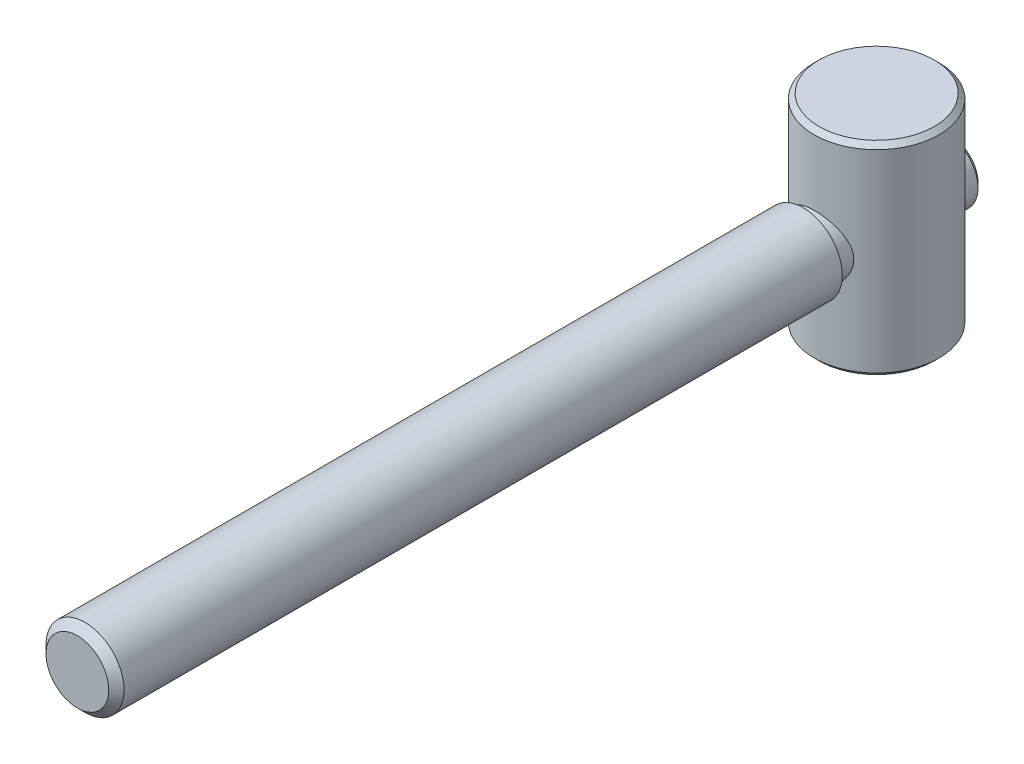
ISO-10303-21;
HEADER;
FILE_DESCRIPTION(('STEP AP214'),'2;1');
FILE_NAME('part.step','',(''),(''),'','','');
FILE_SCHEMA(('AUTOMOTIVE_DESIGN { 1 0 10303 214 1 1 1 1 }'));
ENDSEC;
DATA;
#1=APPLICATION_CONTEXT('core data for automotive mechanical design processes');
#2=APPLICATION_PROTOCOL_DEFINITION('international standard','automotive_design',2000,#1);
#3=PRODUCT_CONTEXT('',#1,'mechanical');
#4=PRODUCT('Part','Part','',(#3));
#5=PRODUCT_RELATED_PRODUCT_CATEGORY('part','',(#4));
#6=PRODUCT_DEFINITION_FORMATION('','',#4);
#7=PRODUCT_DEFINITION_CONTEXT('part definition',#1,'design');
#8=PRODUCT_DEFINITION('design','',#6,#7);
#9=PRODUCT_DEFINITION_SHAPE('','',#8);
#10=(LENGTH_UNIT() NAMED_UNIT(*) SI_UNIT(.MILLI.,.METRE.));
#11=(NAMED_UNIT(*) PLANE_ANGLE_UNIT() SI_UNIT($,.RADIAN.));
#12=(NAMED_UNIT(*) SI_UNIT($,.STERADIAN.) SOLID_ANGLE_UNIT());
#13=UNCERTAINTY_MEASURE_WITH_UNIT(LENGTH_MEASURE(1.E-05),#10,'distance_accuracy_value','');
#14=(GEOMETRIC_REPRESENTATION_CONTEXT(3) GLOBAL_UNCERTAINTY_ASSIGNED_CONTEXT((#13)) GLOBAL_UNIT_ASSIGNED_CONTEXT((#10,
#11,#12)) REPRESENTATION_CONTEXT('',''));
#15=CARTESIAN_POINT('',(0.,0.,0.));
#16=DIRECTION('',(0.,0.,1.));
#17=DIRECTION('',(1.,0.,0.));
#18=AXIS2_PLACEMENT_3D('',#15,#16,#17);
#19=CARTESIAN_POINT('',(-0.4,0.,-46.2));
#20=DIRECTION('',(1.,0.,0.));
#21=DIRECTION('',(0.,-1.,0.));
#22=AXIS2_PLACEMENT_3D('',#19,#20,#21);
#23=CYLINDRICAL_SURFACE('',#22,31.5);
#24=CARTESIAN_POINT('',(-0.4,0.,-46.2));
#25=DIRECTION('',(-1.,0.,0.));
#26=DIRECTION('',(0.,1.,0.));
#27=AXIS2_PLACEMENT_3D('',#24,#25,#26);
#28=CIRCLE('',#27,31.5);
#29=CARTESIAN_POINT('',(-0.4,-1.95959179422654,-14.7610114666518));
#30=VERTEX_POINT('',#29);
#31=CARTESIAN_POINT('',(-0.4,1.95959179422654,-14.7610114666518));
#32=VERTEX_POINT('',#31);
#33=EDGE_CURVE('E118',#30,#32,#28,.T.);
#34=ORIENTED_EDGE('',*,*,#33,.T.);
#35=CARTESIAN_POINT('',(-0.4,1.95959179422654,-14.7610114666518));
#36=CARTESIAN_POINT('',(-0.344561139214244,1.97091486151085,-14.7617184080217));
#37=CARTESIAN_POINT('',(-0.28863792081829,1.97987306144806,-14.762281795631));
#38=CARTESIAN_POINT('',(-0.176213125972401,1.99302430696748,-14.7631121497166));
#39=CARTESIAN_POINT('',(-0.119711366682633,1.99721579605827,-14.7633790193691));
#40=CARTESIAN_POINT('',(-0.00749894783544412,2.0007609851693,-14.7636046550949));
#41=CARTESIAN_POINT('',(0.0482092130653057,2.00019410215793,-14.7635684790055));
#42=CARTESIAN_POINT('',(0.159360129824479,1.99441663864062,-14.7632012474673));
#43=CARTESIAN_POINT('',(0.214802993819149,1.98920814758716,-14.7628703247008));
#44=CARTESIAN_POINT('',(0.313516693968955,1.97576492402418,-14.762023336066));
#45=CARTESIAN_POINT('',(0.356906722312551,1.96839158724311,-14.761560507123));
#46=CARTESIAN_POINT('',(0.4,1.95959179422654,-14.7610114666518));
#47=B_SPLINE_CURVE_WITH_KNOTS('',3,(#35,#36,#37,#38,#39,#40,#41,#42,#43,#44,#45,#46),
.UNSPECIFIED.,.F.,.F.,(4,2,2,2,2,4),(0.,0.169712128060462,0.33947965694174,0.506419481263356,
0.673284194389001,0.805229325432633),.UNSPECIFIED.);
#48=CARTESIAN_POINT('',(0.4,1.95959179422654,-14.7610114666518));
#49=VERTEX_POINT('',#48);
#50=EDGE_CURVE('E208',#32,#49,#47,.T.);
#51=ORIENTED_EDGE('',*,*,#50,.T.);
#52=CARTESIAN_POINT('',(0.4,0.,-46.2));
#53=DIRECTION('',(-1.,0.,0.));
#54=DIRECTION('',(0.,1.,0.));
#55=AXIS2_PLACEMENT_3D('',#52,#53,#54);
#56=CIRCLE('',#55,31.5);
#57=CARTESIAN_POINT('',(0.4,-1.95959179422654,-14.7610114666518));
#58=VERTEX_POINT('',#57);
#59=EDGE_CURVE('E105',#58,#49,#56,.T.);
#60=ORIENTED_EDGE('',*,*,#59,.F.);
#61=CARTESIAN_POINT('',(0.4,-1.95959179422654,-14.7610114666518));
#62=CARTESIAN_POINT('',(0.344561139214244,-1.97091486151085,-14.7617184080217));
#63=CARTESIAN_POINT('',(0.28863792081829,-1.97987306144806,-14.762281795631));
#64=CARTESIAN_POINT('',(0.176213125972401,-1.99302430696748,-14.7631121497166));
#65=CARTESIAN_POINT('',(0.119711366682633,-1.99721579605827,-14.7633790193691));
#66=CARTESIAN_POINT('',(0.00749894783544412,-2.0007609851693,-14.7636046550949));
#67=CARTESIAN_POINT('',(-0.0482092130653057,-2.00019410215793,-14.7635684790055));
#68=CARTESIAN_POINT('',(-0.159360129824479,-1.99441663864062,-14.7632012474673));
#69=CARTESIAN_POINT('',(-0.214802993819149,-1.98920814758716,-14.7628703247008));
#70=CARTESIAN_POINT('',(-0.313516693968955,-1.97576492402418,-14.762023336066));
#71=CARTESIAN_POINT('',(-0.356906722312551,-1.96839158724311,-14.761560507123));
#72=CARTESIAN_POINT('',(-0.4,-1.95959179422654,-14.7610114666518));
#73=B_SPLINE_CURVE_WITH_KNOTS('',3,(#61,#62,#63,#64,#65,#66,#67,#68,#69,#70,#71,#72),
.UNSPECIFIED.,.F.,.F.,(4,2,2,2,2,4),(0.,0.169712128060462,0.33947965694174,0.506419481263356,
0.673284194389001,0.805229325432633),.UNSPECIFIED.);
#74=EDGE_CURVE('E120',#58,#30,#73,.T.);
#75=ORIENTED_EDGE('',*,*,#74,.T.);
#76=EDGE_LOOP('',(#34,#51,#60,#75));
#77=FACE_BOUND('',#76,.T.);
#78=ADVANCED_FACE('F19',(#77),#23,.F.);
#79=CARTESIAN_POINT('',(0.,0.,-6.7));
#80=DIRECTION('',(0.,0.,1.));
#81=DIRECTION('',(1.,0.,0.));
#82=AXIS2_PLACEMENT_3D('',#79,#80,#81);
#83=CYLINDRICAL_SURFACE('',#82,2.);
#84=DIRECTION('',(0.,0.,1.));
#85=VECTOR('',#84,1.);
#86=CARTESIAN_POINT('',(0.4,-1.95959179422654,-16.2));
#87=LINE('',#86,#85);
#88=CARTESIAN_POINT('',(0.4,-1.95959179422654,-15.8935));
#89=VERTEX_POINT('',#88);
#90=CARTESIAN_POINT('',(0.4,-1.95959179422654,-15.3799497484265));
#91=VERTEX_POINT('',#90);
#92=EDGE_CURVE('E315',#89,#91,#87,.T.);
#93=ORIENTED_EDGE('',*,*,#92,.F.);
#94=CARTESIAN_POINT('',(0.,0.,-15.8935));
#95=DIRECTION('',(0.,0.,1.));
#96=DIRECTION('',(1.,0.,0.));
#97=AXIS2_PLACEMENT_3D('',#94,#95,#96);
#98=CIRCLE('',#97,2.);
#99=CARTESIAN_POINT('',(0.4,1.95959179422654,-15.8935));
#100=VERTEX_POINT('',#99);
#101=EDGE_CURVE('E589',#89,#100,#98,.T.);
#102=ORIENTED_EDGE('',*,*,#101,.T.);
#103=DIRECTION('',(0.,0.,1.));
#104=VECTOR('',#103,1.);
#105=CARTESIAN_POINT('',(0.4,1.95959179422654,-16.2));
#106=LINE('',#105,#104);
#107=CARTESIAN_POINT('',(0.4,1.95959179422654,-15.3799497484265));
#108=VERTEX_POINT('',#107);
#109=EDGE_CURVE('E313',#100,#108,#106,.T.);
#110=ORIENTED_EDGE('',*,*,#109,.T.);
#111=CARTESIAN_POINT('',(2.,0.,-14.8641016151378));
#112=CARTESIAN_POINT('',(1.99999158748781,0.104213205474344,-14.8641118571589));
#113=CARTESIAN_POINT('',(1.99179963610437,0.208562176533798,-14.8688763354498));
#114=CARTESIAN_POINT('',(1.95944672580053,0.414055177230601,-14.8872470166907));
#115=CARTESIAN_POINT('',(1.93525221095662,0.515192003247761,-14.9008717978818));
#116=CARTESIAN_POINT('',(1.8721998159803,0.710903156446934,-14.9349870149));
#117=CARTESIAN_POINT('',(1.83341988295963,0.80550925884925,-14.9554408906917));
#118=CARTESIAN_POINT('',(1.74253507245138,0.986848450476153,-15.0008532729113));
#119=CARTESIAN_POINT('',(1.69042947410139,1.07358111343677,-15.0258120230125));
#120=CARTESIAN_POINT('',(1.569333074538,1.24461144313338,-15.0799373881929));
#121=CARTESIAN_POINT('',(1.49930407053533,1.32811826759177,-15.109281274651));
#122=CARTESIAN_POINT('',(1.34650761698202,1.4828167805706,-15.1674396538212));
#123=CARTESIAN_POINT('',(1.26373385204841,1.55400232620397,-15.1962538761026));
#124=CARTESIAN_POINT('',(1.08097912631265,1.6867343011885,-15.2524295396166));
#125=CARTESIAN_POINT('',(0.980214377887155,1.74730753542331,-15.2795621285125));
#126=CARTESIAN_POINT('',(0.768314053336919,1.85028170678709,-15.3270151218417));
#127=CARTESIAN_POINT('',(0.657185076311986,1.8926941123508,-15.3473398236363));
#128=CARTESIAN_POINT('',(0.436089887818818,1.95500932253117,-15.3776092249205));
#129=CARTESIAN_POINT('',(0.326603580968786,1.9762990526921,-15.3881896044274));
#130=CARTESIAN_POINT('',(0.105141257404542,2.00033223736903,-15.4001516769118));
#131=CARTESIAN_POINT('',(-0.00683321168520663,2.00308691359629,-15.4015389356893));
#132=CARTESIAN_POINT('',(-0.219665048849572,1.99050665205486,-15.3952596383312));
#133=CARTESIAN_POINT('',(-0.320642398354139,1.97672396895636,-15.3883699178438));
#134=CARTESIAN_POINT('',(-0.518627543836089,1.93423831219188,-15.3674849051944));
#135=CARTESIAN_POINT('',(-0.615635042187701,1.90553422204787,-15.3534890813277));
#136=CARTESIAN_POINT('',(-0.804618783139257,1.83383486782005,-15.3194316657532));
#137=CARTESIAN_POINT('',(-0.896506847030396,1.79064737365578,-15.299288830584));
#138=CARTESIAN_POINT('',(-1.07195360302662,1.6914731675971,-15.2547529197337));
#139=CARTESIAN_POINT('',(-1.15550929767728,1.63548187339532,-15.2303583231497));
#140=CARTESIAN_POINT('',(-1.3203473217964,1.50620929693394,-15.1768878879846));
#141=CARTESIAN_POINT('',(-1.40066815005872,1.43179394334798,-15.1475875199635));
#142=CARTESIAN_POINT('',(-1.54820874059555,1.27082055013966,-15.0890868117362));
#143=CARTESIAN_POINT('',(-1.61541842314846,1.18425325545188,-15.0598865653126));
#144=CARTESIAN_POINT('',(-1.73901066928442,0.994703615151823,-15.0028831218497));
#145=CARTESIAN_POINT('',(-1.7944346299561,0.89102795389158,-14.9752863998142));
#146=CARTESIAN_POINT('',(-1.88663822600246,0.674124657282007,-14.9275090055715));
#147=CARTESIAN_POINT('',(-1.92343731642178,0.560907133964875,-14.9073206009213));
#148=CARTESIAN_POINT('',(-1.97436042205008,0.337570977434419,-14.8788927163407));
#149=CARTESIAN_POINT('',(-1.99005024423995,0.227917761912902,-14.8698331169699));
#150=CARTESIAN_POINT('',(-2.00303389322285,0.00719731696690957,-14.8623583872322));
#151=CARTESIAN_POINT('',(-2.00034071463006,-0.103868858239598,-14.8639357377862));
#152=CARTESIAN_POINT('',(-1.97807208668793,-0.311307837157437,-14.8766867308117));
#153=CARTESIAN_POINT('',(-1.96037563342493,-0.407958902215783,-14.8867917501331));
#154=CARTESIAN_POINT('',(-1.91139256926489,-0.596735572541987,-14.9138804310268));
#155=CARTESIAN_POINT('',(-1.88010155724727,-0.688859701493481,-14.9308663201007));
#156=CARTESIAN_POINT('',(-1.80329517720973,-0.870822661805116,-14.9707244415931));
#157=CARTESIAN_POINT('',(-1.7571881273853,-0.960358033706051,-14.9938328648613));
#158=CARTESIAN_POINT('',(-1.65257412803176,-1.13093854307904,-15.043122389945));
#159=CARTESIAN_POINT('',(-1.59406080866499,-1.21197928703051,-15.069305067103));
#160=CARTESIAN_POINT('',(-1.45767433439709,-1.37395753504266,-15.1257599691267));
#161=CARTESIAN_POINT('',(-1.37829054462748,-1.45359430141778,-15.1561316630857));
#162=CARTESIAN_POINT('',(-1.20680899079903,-1.59882447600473,-15.214684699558));
#163=CARTESIAN_POINT('',(-1.11470694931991,-1.66441314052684,-15.2428653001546));
#164=CARTESIAN_POINT('',(-0.917070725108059,-1.78114745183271,-15.2948272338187));
#165=CARTESIAN_POINT('',(-0.811246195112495,-1.83186623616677,-15.3184728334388));
#166=CARTESIAN_POINT('',(-0.591044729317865,-1.91427580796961,-15.3576670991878));
#167=CARTESIAN_POINT('',(-0.476675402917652,-1.9459833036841,-15.373222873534));
#168=CARTESIAN_POINT('',(-0.253959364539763,-1.98673712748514,-15.3933501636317));
#169=CARTESIAN_POINT('',(-0.1460228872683,-1.99759574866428,-15.3987985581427));
#170=CARTESIAN_POINT('',(0.0702519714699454,-2.00168653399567,-15.4008426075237));
#171=CARTESIAN_POINT('',(0.178590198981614,-1.99492486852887,-15.3974413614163));
#172=CARTESIAN_POINT('',(0.385075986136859,-1.96516717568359,-15.3826793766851));
#173=CARTESIAN_POINT('',(0.483424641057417,-1.94327026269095,-15.3718578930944));
#174=CARTESIAN_POINT('',(0.674891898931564,-1.88534604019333,-15.3438418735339));
#175=CARTESIAN_POINT('',(0.768009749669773,-1.84931670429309,-15.3266464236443));
#176=CARTESIAN_POINT('',(0.95084683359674,-1.7625457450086,-15.2865186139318));
#177=CARTESIAN_POINT('',(1.04025036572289,-1.71124078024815,-15.263372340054));
#178=CARTESIAN_POINT('',(1.20954920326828,-1.59608471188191,-15.2137626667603));
#179=CARTESIAN_POINT('',(1.28944011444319,-1.53222784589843,-15.1872977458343));
#180=CARTESIAN_POINT('',(1.44582833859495,-1.38640336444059,-15.1305721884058));
#181=CARTESIAN_POINT('',(1.52119665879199,-1.30326581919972,-15.1001959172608));
#182=CARTESIAN_POINT('',(1.65732528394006,-1.12510777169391,-15.0412615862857));
#183=CARTESIAN_POINT('',(1.71807266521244,-1.03007686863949,-15.0127051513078));
#184=CARTESIAN_POINT('',(1.82486714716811,-0.826691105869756,-14.9599918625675));
#185=CARTESIAN_POINT('',(1.87038902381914,-0.718010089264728,-14.9360025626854));
#186=CARTESIAN_POINT('',(1.92395929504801,-0.549421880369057,-14.9069621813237));
#187=CARTESIAN_POINT('',(1.93935666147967,-0.492352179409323,-14.898443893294));
#188=CARTESIAN_POINT('',(1.96508069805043,-0.376767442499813,-14.8840605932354));
#189=CARTESIAN_POINT('',(1.97541091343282,-0.318253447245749,-14.8781937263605));
#190=CARTESIAN_POINT('',(1.9887293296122,-0.21639921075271,-14.8705902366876));
#191=CARTESIAN_POINT('',(1.99295091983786,-0.173266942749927,-14.8681638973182));
#192=CARTESIAN_POINT('',(1.99858810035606,-0.0867643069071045,-14.8649174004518));
#193=CARTESIAN_POINT('',(2.00000350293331,-0.0433939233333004,-14.8640973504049));
#194=CARTESIAN_POINT('',(2.,0.,-14.8641016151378));
#195=B_SPLINE_CURVE_WITH_KNOTS('',3,(#111,#112,#113,#114,#115,#116,#117,#118,#119,#120,#121,
#122,#123,#124,#125,#126,#127,#128,#129,#130,#131,#132,#133,#134,#135,#136,#137,#138,#139,#140,
#141,#142,#143,#144,#145,#146,#147,#148,#149,#150,#151,#152,#153,#154,#155,#156,#157,#158,#159,
#160,#161,#162,#163,#164,#165,#166,#167,#168,#169,#170,#171,#172,#173,#174,#175,#176,#177,#178,
#179,#180,#181,#182,#183,#184,#185,#186,#187,#188,#189,#190,#191,#192,#193,#194),.UNSPECIFIED.,
.T.,.F.,(4,2,2,2,2,2,2,2,2,2,2,2,2,2,2,2,2,2,2,2,2,2,2,2,2,2,2,2,2,2,2,2,2,2,2,2,2,2,2,2,2,4),
(0.,0.312464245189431,0.625585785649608,0.937057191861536,1.24854545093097,1.58572462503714,
1.92307142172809,2.28315784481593,2.64301653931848,2.97726969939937,3.31132047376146,
3.61632194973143,3.92134625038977,4.2305906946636,4.5399459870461,4.87854382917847,
5.21740096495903,5.57777683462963,5.93777548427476,6.2692458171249,6.60048186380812,
6.89548366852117,7.19058104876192,7.49934592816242,7.80826972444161,8.15613487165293,
8.50411729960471,8.86128362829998,9.21813559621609,9.5422454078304,9.8662417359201,
10.1688884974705,10.4715786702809,10.7872150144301,11.102996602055,11.450204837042,
11.7977188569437,12.1562149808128,12.3351395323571,12.5139387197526,12.6440387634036,
12.7741475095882),.UNSPECIFIED.);
#196=EDGE_CURVE('E113',#91,#108,#195,.T.);
#197=ORIENTED_EDGE('',*,*,#196,.F.);
#198=EDGE_LOOP('',(#93,#102,#110,#197));
#199=FACE_BOUND('',#198,.T.);
#200=ADVANCED_FACE('F222',(#199),#83,.T.);
#201=CARTESIAN_POINT('',(0.4,0.,-46.2));
#202=DIRECTION('',(-1.,0.,0.));
#203=DIRECTION('',(0.,1.,0.));
#204=AXIS2_PLACEMENT_3D('',#201,#202,#203);
#205=PLANE('',#204);
#206=DIRECTION('',(0.,1.,0.));
#207=VECTOR('',#206,1.);
#208=CARTESIAN_POINT('',(0.4,1.95959179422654,-16.2));
#209=LINE('',#208,#207);
#210=CARTESIAN_POINT('',(0.4,-1.64558264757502,-16.2));
#211=VERTEX_POINT('',#210);
#212=CARTESIAN_POINT('',(0.4,1.64558264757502,-16.2));
#213=VERTEX_POINT('',#212);
#214=EDGE_CURVE('E309',#211,#213,#209,.T.);
#215=ORIENTED_EDGE('',*,*,#214,.F.);
#216=CARTESIAN_POINT('',(0.4,-1.64558264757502,-16.2));
#217=CARTESIAN_POINT('',(0.4,-1.69802260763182,-16.149024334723));
#218=CARTESIAN_POINT('',(0.4,-1.75041001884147,-16.0979948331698));
#219=CARTESIAN_POINT('',(0.4,-1.85507973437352,-15.9958281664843));
#220=CARTESIAN_POINT('',(0.4,-1.90736203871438,-15.9446910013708));
#221=CARTESIAN_POINT('',(0.4,-1.95959179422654,-15.8935));
#222=B_SPLINE_CURVE_WITH_KNOTS('',3,(#216,#217,#218,#219,#220,#221),.UNSPECIFIED.,.F.,.F.,(4,2,
4),(0.,0.219399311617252,0.438798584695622),.UNSPECIFIED.);
#223=EDGE_CURVE('E249',#211,#89,#222,.T.);
#224=ORIENTED_EDGE('',*,*,#223,.T.);
#225=ORIENTED_EDGE('',*,*,#92,.T.);
#226=DIRECTION('',(0.,0.,1.));
#227=VECTOR('',#226,1.);
#228=CARTESIAN_POINT('',(0.4,-1.95959179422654,-6.7));
#229=LINE('',#228,#227);
#230=EDGE_CURVE('E101',#91,#58,#229,.T.);
#231=ORIENTED_EDGE('',*,*,#230,.T.);
#232=ORIENTED_EDGE('',*,*,#59,.T.);
#233=DIRECTION('',(0.,0.,1.));
#234=VECTOR('',#233,1.);
#235=CARTESIAN_POINT('',(0.4,1.95959179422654,-6.7));
#236=LINE('',#235,#234);
#237=EDGE_CURVE('E197',#49,#108,#236,.F.);
#238=ORIENTED_EDGE('',*,*,#237,.T.);
#239=ORIENTED_EDGE('',*,*,#109,.F.);
#240=CARTESIAN_POINT('',(0.4,1.95959179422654,-15.8935));
#241=CARTESIAN_POINT('',(0.4,1.90736203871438,-15.9446910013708));
#242=CARTESIAN_POINT('',(0.4,1.85507973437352,-15.9958281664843));
#243=CARTESIAN_POINT('',(0.4,1.75041001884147,-16.0979948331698));
#244=CARTESIAN_POINT('',(0.4,1.69802260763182,-16.149024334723));
#245=CARTESIAN_POINT('',(0.4,1.64558264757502,-16.2));
#246=B_SPLINE_CURVE_WITH_KNOTS('',3,(#240,#241,#242,#243,#244,#245),.UNSPECIFIED.,.F.,.F.,(4,2,
4),(0.,0.21939927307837,0.438798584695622),.UNSPECIFIED.);
#247=EDGE_CURVE('E242',#100,#213,#246,.T.);
#248=ORIENTED_EDGE('',*,*,#247,.T.);
#249=EDGE_LOOP('',(#215,#224,#225,#231,#232,#238,#239,#248));
#250=FACE_BOUND('',#249,.T.);
#251=ADVANCED_FACE('F224',(#250),#205,.T.);
#252=DIRECTION('',(0.,0.,1.));
#253=VECTOR('',#252,1.);
#254=CARTESIAN_POINT('',(-0.4,1.95959179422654,-16.2));
#255=LINE('',#254,#253);
#256=CARTESIAN_POINT('',(-0.4,1.95959179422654,-15.8935));
#257=VERTEX_POINT('',#256);
#258=CARTESIAN_POINT('',(-0.4,1.95959179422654,-15.3799497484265));
#259=VERTEX_POINT('',#258);
#260=EDGE_CURVE('E89',#257,#259,#255,.T.);
#261=ORIENTED_EDGE('',*,*,#260,.F.);
#262=CARTESIAN_POINT('',(0.,0.,-15.8935));
#263=DIRECTION('',(0.,0.,1.));
#264=DIRECTION('',(1.,0.,0.));
#265=AXIS2_PLACEMENT_3D('',#262,#263,#264);
#266=CIRCLE('',#265,2.);
#267=CARTESIAN_POINT('',(-0.4,-1.95959179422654,-15.8935));
#268=VERTEX_POINT('',#267);
#269=EDGE_CURVE('E11',#257,#268,#266,.T.);
#270=ORIENTED_EDGE('',*,*,#269,.T.);
#271=DIRECTION('',(0.,0.,1.));
#272=VECTOR('',#271,1.);
#273=CARTESIAN_POINT('',(-0.4,-1.95959179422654,-16.2));
#274=LINE('',#273,#272);
#275=CARTESIAN_POINT('',(-0.4,-1.95959179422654,-15.3799497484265));
#276=VERTEX_POINT('',#275);
#277=EDGE_CURVE('E81',#268,#276,#274,.T.);
#278=ORIENTED_EDGE('',*,*,#277,.T.);
#279=EDGE_CURVE('E85',#259,#276,#195,.T.);
#280=ORIENTED_EDGE('',*,*,#279,.F.);
#281=EDGE_LOOP('',(#261,#270,#278,#280));
#282=FACE_BOUND('',#281,.T.);
#283=ADVANCED_FACE('F83',(#282),#83,.T.);
#284=CARTESIAN_POINT('',(-0.4,0.,-46.2));
#285=DIRECTION('',(-1.,0.,0.));
#286=DIRECTION('',(0.,1.,0.));
#287=AXIS2_PLACEMENT_3D('',#284,#285,#286);
#288=PLANE('',#287);
#289=DIRECTION('',(0.,-1.,0.));
#290=VECTOR('',#289,1.);
#291=CARTESIAN_POINT('',(-0.4,-1.95959179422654,-16.2));
#292=LINE('',#291,#290);
#293=CARTESIAN_POINT('',(-0.4,1.64558264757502,-16.2));
#294=VERTEX_POINT('',#293);
#295=CARTESIAN_POINT('',(-0.4,-1.64558264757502,-16.2));
#296=VERTEX_POINT('',#295);
#297=EDGE_CURVE('E90',#294,#296,#292,.T.);
#298=ORIENTED_EDGE('',*,*,#297,.F.);
#299=CARTESIAN_POINT('',(-0.4,1.64558264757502,-16.2));
#300=CARTESIAN_POINT('',(-0.4,1.69802260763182,-16.149024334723));
#301=CARTESIAN_POINT('',(-0.4,1.75041001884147,-16.0979948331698));
#302=CARTESIAN_POINT('',(-0.4,1.85507973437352,-15.9958281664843));
#303=CARTESIAN_POINT('',(-0.4,1.90736203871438,-15.9446910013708));
#304=CARTESIAN_POINT('',(-0.4,1.95959179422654,-15.8935));
#305=B_SPLINE_CURVE_WITH_KNOTS('',3,(#299,#300,#301,#302,#303,#304),.UNSPECIFIED.,.F.,.F.,(4,2,
4),(0.,0.219399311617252,0.438798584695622),.UNSPECIFIED.);
#306=EDGE_CURVE('E29',#294,#257,#305,.T.);
#307=ORIENTED_EDGE('',*,*,#306,.T.);
#308=ORIENTED_EDGE('',*,*,#260,.T.);
#309=DIRECTION('',(0.,0.,1.));
#310=VECTOR('',#309,1.);
#311=CARTESIAN_POINT('',(-0.4,1.95959179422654,-6.7));
#312=LINE('',#311,#310);
#313=EDGE_CURVE('E164',#32,#259,#312,.F.);
#314=ORIENTED_EDGE('',*,*,#313,.F.);
#315=ORIENTED_EDGE('',*,*,#33,.F.);
#316=DIRECTION('',(0.,0.,1.));
#317=VECTOR('',#316,1.);
#318=CARTESIAN_POINT('',(-0.4,-1.95959179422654,-6.7));
#319=LINE('',#318,#317);
#320=EDGE_CURVE('E99',#276,#30,#319,.T.);
#321=ORIENTED_EDGE('',*,*,#320,.F.);
#322=ORIENTED_EDGE('',*,*,#277,.F.);
#323=CARTESIAN_POINT('',(-0.4,-1.95959179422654,-15.8935));
#324=CARTESIAN_POINT('',(-0.4,-1.90736203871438,-15.9446910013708));
#325=CARTESIAN_POINT('',(-0.4,-1.85507973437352,-15.9958281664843));
#326=CARTESIAN_POINT('',(-0.4,-1.75041001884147,-16.0979948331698));
#327=CARTESIAN_POINT('',(-0.4,-1.69802260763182,-16.149024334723));
#328=CARTESIAN_POINT('',(-0.4,-1.64558264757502,-16.2));
#329=B_SPLINE_CURVE_WITH_KNOTS('',3,(#323,#324,#325,#326,#327,#328),.UNSPECIFIED.,.F.,.F.,(4,2,
4),(0.,0.21939927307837,0.438798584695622),.UNSPECIFIED.);
#330=EDGE_CURVE('E576',#268,#296,#329,.T.);
#331=ORIENTED_EDGE('',*,*,#330,.T.);
#332=EDGE_LOOP('',(#298,#307,#308,#314,#315,#321,#322,#331));
#333=FACE_BOUND('',#332,.T.);
#334=ADVANCED_FACE('F115',(#333),#288,.F.);
#335=CARTESIAN_POINT('',(0.,-6.5,-11.4));
#336=DIRECTION('',(0.,-1.,0.));
#337=DIRECTION('',(-1.,0.,0.));
#338=AXIS2_PLACEMENT_3D('',#335,#336,#337);
#339=PLANE('',#338);
#340=CARTESIAN_POINT('',(0.,-6.5,-11.4));
#341=DIRECTION('',(0.,-1.,0.));
#342=DIRECTION('',(0.,0.,-1.));
#343=AXIS2_PLACEMENT_3D('',#340,#341,#342);
#344=CIRCLE('',#343,3.6935);
#345=CARTESIAN_POINT('',(0.,-6.5,-15.0935));
#346=VERTEX_POINT('',#345);
#347=EDGE_CURVE('E294',#346,#346,#344,.T.);
#348=ORIENTED_EDGE('',*,*,#347,.T.);
#349=EDGE_LOOP('',(#348));
#350=FACE_BOUND('',#349,.T.);
#351=ADVANCED_FACE('F343',(#350),#339,.T.);
#352=CARTESIAN_POINT('',(0.,6.5,-11.4));
#353=DIRECTION('',(0.,1.,0.));
#354=DIRECTION('',(1.,0.,0.));
#355=AXIS2_PLACEMENT_3D('',#352,#353,#354);
#356=PLANE('',#355);
#357=CARTESIAN_POINT('',(0.,6.5,-11.4));
#358=DIRECTION('',(0.,1.,0.));
#359=DIRECTION('',(0.,0.,1.));
#360=AXIS2_PLACEMENT_3D('',#357,#358,#359);
#361=CIRCLE('',#360,3.6935);
#362=CARTESIAN_POINT('',(0.,6.5,-7.7065));
#363=VERTEX_POINT('',#362);
#364=EDGE_CURVE('E285',#363,#363,#361,.T.);
#365=ORIENTED_EDGE('',*,*,#364,.T.);
#366=EDGE_LOOP('',(#365));
#367=FACE_BOUND('',#366,.T.);
#368=ADVANCED_FACE('F341',(#367),#356,.T.);
#369=CARTESIAN_POINT('',(0.,6.5,-11.4));
#370=DIRECTION('',(0.,1.,0.));
#371=DIRECTION('',(1.,0.,0.));
#372=AXIS2_PLACEMENT_3D('',#369,#370,#371);
#373=CYLINDRICAL_SURFACE('',#372,4.);
#374=CARTESIAN_POINT('',(0.,-6.1935,-11.4));
#375=DIRECTION('',(0.,-1.,0.));
#376=DIRECTION('',(0.,0.,-1.));
#377=AXIS2_PLACEMENT_3D('',#374,#375,#376);
#378=CIRCLE('',#377,4.);
#379=CARTESIAN_POINT('',(0.,-6.1935,-15.4));
#380=VERTEX_POINT('',#379);
#381=EDGE_CURVE('E290',#380,#380,#378,.F.);
#382=ORIENTED_EDGE('',*,*,#381,.T.);
#383=EDGE_LOOP('',(#382));
#384=FACE_BOUND('',#383,.T.);
#385=CARTESIAN_POINT('',(0.,6.1935,-11.4));
#386=DIRECTION('',(0.,1.,0.));
#387=DIRECTION('',(0.,0.,1.));
#388=AXIS2_PLACEMENT_3D('',#385,#386,#387);
#389=CIRCLE('',#388,4.);
#390=CARTESIAN_POINT('',(0.,6.1935,-7.4));
#391=VERTEX_POINT('',#390);
#392=EDGE_CURVE('E288',#391,#391,#389,.F.);
#393=ORIENTED_EDGE('',*,*,#392,.T.);
#394=EDGE_LOOP('',(#393));
#395=FACE_BOUND('',#394,.T.);
#396=CARTESIAN_POINT('',(2.,0.,-7.93589838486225));
#397=CARTESIAN_POINT('',(1.99999158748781,-0.104213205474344,-7.93588814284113));
#398=CARTESIAN_POINT('',(1.99179963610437,-0.208562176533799,-7.93112366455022));
#399=CARTESIAN_POINT('',(1.95944672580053,-0.414055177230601,-7.91275298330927));
#400=CARTESIAN_POINT('',(1.93525221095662,-0.515192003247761,-7.89912820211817));
#401=CARTESIAN_POINT('',(1.8721998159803,-0.710903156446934,-7.86501298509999));
#402=CARTESIAN_POINT('',(1.83341988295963,-0.80550925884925,-7.84455910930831));
#403=CARTESIAN_POINT('',(1.74253507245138,-0.986848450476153,-7.79914672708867));
#404=CARTESIAN_POINT('',(1.69042947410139,-1.07358111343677,-7.77418797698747));
#405=CARTESIAN_POINT('',(1.569333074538,-1.24461144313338,-7.72006261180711));
#406=CARTESIAN_POINT('',(1.49930407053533,-1.32811826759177,-7.69071872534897));
#407=CARTESIAN_POINT('',(1.34650761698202,-1.4828167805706,-7.63256034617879));
#408=CARTESIAN_POINT('',(1.26373385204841,-1.55400232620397,-7.60374612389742));
#409=CARTESIAN_POINT('',(1.08097912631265,-1.6867343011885,-7.5475704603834));
#410=CARTESIAN_POINT('',(0.980214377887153,-1.74730753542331,-7.52043787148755));
#411=CARTESIAN_POINT('',(0.768314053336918,-1.85028170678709,-7.47298487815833));
#412=CARTESIAN_POINT('',(0.657185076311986,-1.8926941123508,-7.45266017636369));
#413=CARTESIAN_POINT('',(0.436089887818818,-1.95500932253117,-7.42239077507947));
#414=CARTESIAN_POINT('',(0.326603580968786,-1.9762990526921,-7.4118103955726));
#415=CARTESIAN_POINT('',(0.105141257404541,-2.00033223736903,-7.39984832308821));
#416=CARTESIAN_POINT('',(-0.00683321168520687,-2.00308691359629,-7.39846106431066));
#417=CARTESIAN_POINT('',(-0.219665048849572,-1.99050665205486,-7.40474036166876));
#418=CARTESIAN_POINT('',(-0.320642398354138,-1.97672396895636,-7.41163008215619));
#419=CARTESIAN_POINT('',(-0.518627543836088,-1.93423831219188,-7.43251509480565));
#420=CARTESIAN_POINT('',(-0.6156350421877,-1.90553422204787,-7.44651091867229));
#421=CARTESIAN_POINT('',(-0.804618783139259,-1.83383486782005,-7.48056833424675));
#422=CARTESIAN_POINT('',(-0.896506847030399,-1.79064737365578,-7.50071116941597));
#423=CARTESIAN_POINT('',(-1.07195360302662,-1.6914731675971,-7.5452470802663));
#424=CARTESIAN_POINT('',(-1.15550929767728,-1.63548187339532,-7.56964167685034));
#425=CARTESIAN_POINT('',(-1.3203473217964,-1.50620929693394,-7.62311211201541));
#426=CARTESIAN_POINT('',(-1.40066815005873,-1.43179394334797,-7.6524124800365));
#427=CARTESIAN_POINT('',(-1.54820874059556,-1.27082055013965,-7.71091318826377));
#428=CARTESIAN_POINT('',(-1.61541842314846,-1.18425325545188,-7.74011343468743));
#429=CARTESIAN_POINT('',(-1.73901066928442,-0.994703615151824,-7.79711687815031));
#430=CARTESIAN_POINT('',(-1.7944346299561,-0.891027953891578,-7.82471360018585));
#431=CARTESIAN_POINT('',(-1.88663822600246,-0.674124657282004,-7.87249099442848));
#432=CARTESIAN_POINT('',(-1.92343731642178,-0.560907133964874,-7.89267939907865));
#433=CARTESIAN_POINT('',(-1.97436042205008,-0.33757097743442,-7.92110728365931));
#434=CARTESIAN_POINT('',(-1.99005024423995,-0.227917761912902,-7.93016688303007));
#435=CARTESIAN_POINT('',(-2.00303389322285,-0.00719731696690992,-7.93764161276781));
#436=CARTESIAN_POINT('',(-2.00034071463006,0.103868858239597,-7.93606426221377));
#437=CARTESIAN_POINT('',(-1.97807208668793,0.311307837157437,-7.9233132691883));
#438=CARTESIAN_POINT('',(-1.96037563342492,0.407958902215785,-7.91320824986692));
#439=CARTESIAN_POINT('',(-1.91139256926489,0.596735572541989,-7.88611956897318));
#440=CARTESIAN_POINT('',(-1.88010155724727,0.688859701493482,-7.86913367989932));
#441=CARTESIAN_POINT('',(-1.80329517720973,0.870822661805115,-7.82927555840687));
#442=CARTESIAN_POINT('',(-1.7571881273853,0.960358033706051,-7.80616713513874));
#443=CARTESIAN_POINT('',(-1.65257412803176,1.13093854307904,-7.756877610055));
#444=CARTESIAN_POINT('',(-1.59406080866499,1.21197928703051,-7.73069493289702));
#445=CARTESIAN_POINT('',(-1.45767433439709,1.37395753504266,-7.67424003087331));
#446=CARTESIAN_POINT('',(-1.37829054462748,1.45359430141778,-7.64386833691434));
#447=CARTESIAN_POINT('',(-1.20680899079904,1.59882447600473,-7.58531530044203));
#448=CARTESIAN_POINT('',(-1.11470694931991,1.66441314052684,-7.55713469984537));
#449=CARTESIAN_POINT('',(-0.917070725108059,1.78114745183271,-7.50517276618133));
#450=CARTESIAN_POINT('',(-0.811246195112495,1.83186623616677,-7.48152716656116));
#451=CARTESIAN_POINT('',(-0.591044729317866,1.91427580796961,-7.44233290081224));
#452=CARTESIAN_POINT('',(-0.476675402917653,1.9459833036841,-7.42677712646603));
#453=CARTESIAN_POINT('',(-0.253959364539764,1.98673712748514,-7.40664983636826));
#454=CARTESIAN_POINT('',(-0.1460228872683,1.99759574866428,-7.4012014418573));
#455=CARTESIAN_POINT('',(0.0702519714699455,2.00168653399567,-7.39915739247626));
#456=CARTESIAN_POINT('',(0.178590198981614,1.99492486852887,-7.40255863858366));
#457=CARTESIAN_POINT('',(0.385075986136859,1.96516717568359,-7.41732062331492));
#458=CARTESIAN_POINT('',(0.483424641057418,1.94327026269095,-7.42814210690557));
#459=CARTESIAN_POINT('',(0.674891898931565,1.88534604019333,-7.45615812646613));
#460=CARTESIAN_POINT('',(0.768009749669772,1.84931670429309,-7.47335357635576));
#461=CARTESIAN_POINT('',(0.950846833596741,1.7625457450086,-7.51348138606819));
#462=CARTESIAN_POINT('',(1.0402503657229,1.71124078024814,-7.53662765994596));
#463=CARTESIAN_POINT('',(1.20954920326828,1.59608471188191,-7.58623733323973));
#464=CARTESIAN_POINT('',(1.28944011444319,1.53222784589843,-7.61270225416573));
#465=CARTESIAN_POINT('',(1.44582833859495,1.38640336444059,-7.66942781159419));
#466=CARTESIAN_POINT('',(1.52119665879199,1.30326581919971,-7.69980408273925));
#467=CARTESIAN_POINT('',(1.65732528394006,1.12510777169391,-7.75873841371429));
#468=CARTESIAN_POINT('',(1.71807266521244,1.03007686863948,-7.78729484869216));
#469=CARTESIAN_POINT('',(1.82486714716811,0.826691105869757,-7.84000813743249));
#470=CARTESIAN_POINT('',(1.87038902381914,0.718010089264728,-7.86399743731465));
#471=CARTESIAN_POINT('',(1.92395929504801,0.549421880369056,-7.8930378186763));
#472=CARTESIAN_POINT('',(1.93935666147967,0.492352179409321,-7.90155610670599));
#473=CARTESIAN_POINT('',(1.96508069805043,0.376767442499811,-7.91593940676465));
#474=CARTESIAN_POINT('',(1.97541091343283,0.318253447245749,-7.9218062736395));
#475=CARTESIAN_POINT('',(1.9887293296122,0.21639921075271,-7.92940976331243));
#476=CARTESIAN_POINT('',(1.99295091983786,0.173266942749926,-7.93183610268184));
#477=CARTESIAN_POINT('',(1.99858810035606,0.086764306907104,-7.93508259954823));
#478=CARTESIAN_POINT('',(2.00000350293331,0.0433939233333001,-7.93590264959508));
#479=CARTESIAN_POINT('',(2.,0.,-7.93589838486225));
#480=B_SPLINE_CURVE_WITH_KNOTS('',3,(#396,#397,#398,#399,#400,#401,#402,#403,#404,#405,#406,
#407,#408,#409,#410,#411,#412,#413,#414,#415,#416,#417,#418,#419,#420,#421,#422,#423,#424,#425,
#426,#427,#428,#429,#430,#431,#432,#433,#434,#435,#436,#437,#438,#439,#440,#441,#442,#443,#444,
#445,#446,#447,#448,#449,#450,#451,#452,#453,#454,#455,#456,#457,#458,#459,#460,#461,#462,#463,
#464,#465,#466,#467,#468,#469,#470,#471,#472,#473,#474,#475,#476,#477,#478,#479),.UNSPECIFIED.,
.T.,.F.,(4,2,2,2,2,2,2,2,2,2,2,2,2,2,2,2,2,2,2,2,2,2,2,2,2,2,2,2,2,2,2,2,2,2,2,2,2,2,2,2,2,4),
(0.,0.312464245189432,0.62558578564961,0.937057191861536,1.24854545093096,1.58572462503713,
1.92307142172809,2.28315784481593,2.64301653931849,2.97726969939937,3.31132047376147,
3.61632194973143,3.92134625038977,4.2305906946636,4.53994598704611,4.87854382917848,
5.21740096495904,5.57777683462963,5.93777548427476,6.2692458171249,6.60048186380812,
6.89548366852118,7.19058104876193,7.49934592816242,7.80826972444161,8.15613487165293,
8.50411729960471,8.86128362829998,9.2181355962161,9.5422454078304,9.8662417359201,
10.1688884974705,10.4715786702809,10.7872150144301,11.102996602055,11.450204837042,
11.7977188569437,12.1562149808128,12.3351395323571,12.5139387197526,12.6440387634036,
12.7741475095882),.UNSPECIFIED.);
#481=CARTESIAN_POINT('',(2.,0.,-7.93589838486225));
#482=VERTEX_POINT('',#481);
#483=EDGE_CURVE('E112',#482,#482,#480,.T.);
#484=ORIENTED_EDGE('',*,*,#483,.T.);
#485=EDGE_LOOP('',(#484));
#486=FACE_BOUND('',#485,.T.);
#487=CARTESIAN_POINT('',(-2.,0.,-14.8641016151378));
#488=CARTESIAN_POINT('',(-1.99999158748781,-0.104213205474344,-14.8641118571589));
#489=CARTESIAN_POINT('',(-1.99179963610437,-0.208562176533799,-14.8688763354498));
#490=CARTESIAN_POINT('',(-1.95944672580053,-0.414055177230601,-14.8872470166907));
#491=CARTESIAN_POINT('',(-1.93525221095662,-0.515192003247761,-14.9008717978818));
#492=CARTESIAN_POINT('',(-1.8721998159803,-0.710903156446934,-14.9349870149));
#493=CARTESIAN_POINT('',(-1.83341988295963,-0.80550925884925,-14.9554408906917));
#494=CARTESIAN_POINT('',(-1.74253507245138,-0.986848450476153,-15.0008532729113));
#495=CARTESIAN_POINT('',(-1.69042947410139,-1.07358111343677,-15.0258120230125));
#496=CARTESIAN_POINT('',(-1.569333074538,-1.24461144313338,-15.0799373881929));
#497=CARTESIAN_POINT('',(-1.49930407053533,-1.32811826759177,-15.109281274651));
#498=CARTESIAN_POINT('',(-1.34650761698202,-1.4828167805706,-15.1674396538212));
#499=CARTESIAN_POINT('',(-1.26373385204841,-1.55400232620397,-15.1962538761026));
#500=CARTESIAN_POINT('',(-1.08097912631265,-1.6867343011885,-15.2524295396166));
#501=CARTESIAN_POINT('',(-0.980214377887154,-1.74730753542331,-15.2795621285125));
#502=CARTESIAN_POINT('',(-0.768314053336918,-1.85028170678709,-15.3270151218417));
#503=CARTESIAN_POINT('',(-0.657185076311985,-1.8926941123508,-15.3473398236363));
#504=CARTESIAN_POINT('',(-0.436089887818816,-1.95500932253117,-15.3776092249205));
#505=CARTESIAN_POINT('',(-0.326603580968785,-1.9762990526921,-15.3881896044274));
#506=CARTESIAN_POINT('',(-0.105141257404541,-2.00033223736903,-15.4001516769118));
#507=CARTESIAN_POINT('',(0.0068332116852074,-2.00308691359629,-15.4015389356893));
#508=CARTESIAN_POINT('',(0.219665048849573,-1.99050665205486,-15.3952596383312));
#509=CARTESIAN_POINT('',(0.32064239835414,-1.97672396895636,-15.3883699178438));
#510=CARTESIAN_POINT('',(0.51862754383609,-1.93423831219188,-15.3674849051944));
#511=CARTESIAN_POINT('',(0.615635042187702,-1.90553422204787,-15.3534890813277));
#512=CARTESIAN_POINT('',(0.804618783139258,-1.83383486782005,-15.3194316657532));
#513=CARTESIAN_POINT('',(0.896506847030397,-1.79064737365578,-15.299288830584));
#514=CARTESIAN_POINT('',(1.07195360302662,-1.6914731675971,-15.2547529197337));
#515=CARTESIAN_POINT('',(1.15550929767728,-1.63548187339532,-15.2303583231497));
#516=CARTESIAN_POINT('',(1.3203473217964,-1.50620929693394,-15.1768878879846));
#517=CARTESIAN_POINT('',(1.40066815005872,-1.43179394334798,-15.1475875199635));
#518=CARTESIAN_POINT('',(1.54820874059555,-1.27082055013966,-15.0890868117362));
#519=CARTESIAN_POINT('',(1.61541842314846,-1.18425325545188,-15.0598865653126));
#520=CARTESIAN_POINT('',(1.73901066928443,-0.994703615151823,-15.0028831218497));
#521=CARTESIAN_POINT('',(1.7944346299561,-0.89102795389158,-14.9752863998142));
#522=CARTESIAN_POINT('',(1.88663822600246,-0.674124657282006,-14.9275090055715));
#523=CARTESIAN_POINT('',(1.92343731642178,-0.560907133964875,-14.9073206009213));
#524=CARTESIAN_POINT('',(1.97436042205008,-0.337570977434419,-14.8788927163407));
#525=CARTESIAN_POINT('',(1.99005024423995,-0.227917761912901,-14.8698331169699));
#526=CARTESIAN_POINT('',(2.00303389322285,-0.00719731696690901,-14.8623583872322));
#527=CARTESIAN_POINT('',(2.00034071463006,0.103868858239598,-14.8639357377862));
#528=CARTESIAN_POINT('',(1.97807208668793,0.311307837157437,-14.8766867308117));
#529=CARTESIAN_POINT('',(1.96037563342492,0.407958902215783,-14.8867917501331));
#530=CARTESIAN_POINT('',(1.91139256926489,0.596735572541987,-14.9138804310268));
#531=CARTESIAN_POINT('',(1.88010155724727,0.688859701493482,-14.9308663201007));
#532=CARTESIAN_POINT('',(1.80329517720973,0.870822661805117,-14.9707244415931));
#533=CARTESIAN_POINT('',(1.7571881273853,0.960358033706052,-14.9938328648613));
#534=CARTESIAN_POINT('',(1.65257412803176,1.13093854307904,-15.043122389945));
#535=CARTESIAN_POINT('',(1.59406080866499,1.21197928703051,-15.069305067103));
#536=CARTESIAN_POINT('',(1.45767433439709,1.37395753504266,-15.1257599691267));
#537=CARTESIAN_POINT('',(1.37829054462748,1.45359430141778,-15.1561316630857));
#538=CARTESIAN_POINT('',(1.20680899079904,1.59882447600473,-15.214684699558));
#539=CARTESIAN_POINT('',(1.11470694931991,1.66441314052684,-15.2428653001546));
#540=CARTESIAN_POINT('',(0.917070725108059,1.78114745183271,-15.2948272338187));
#541=CARTESIAN_POINT('',(0.811246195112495,1.83186623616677,-15.3184728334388));
#542=CARTESIAN_POINT('',(0.591044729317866,1.91427580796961,-15.3576670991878));
#543=CARTESIAN_POINT('',(0.476675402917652,1.9459833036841,-15.373222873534));
#544=CARTESIAN_POINT('',(0.253959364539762,1.98673712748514,-15.3933501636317));
#545=CARTESIAN_POINT('',(0.146022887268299,1.99759574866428,-15.3987985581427));
#546=CARTESIAN_POINT('',(-0.0702519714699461,2.00168653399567,-15.4008426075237));
#547=CARTESIAN_POINT('',(-0.178590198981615,1.99492486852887,-15.3974413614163));
#548=CARTESIAN_POINT('',(-0.385075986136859,1.96516717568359,-15.3826793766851));
#549=CARTESIAN_POINT('',(-0.483424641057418,1.94327026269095,-15.3718578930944));
#550=CARTESIAN_POINT('',(-0.674891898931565,1.88534604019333,-15.3438418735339));
#551=CARTESIAN_POINT('',(-0.768009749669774,1.84931670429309,-15.3266464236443));
#552=CARTESIAN_POINT('',(-0.950846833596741,1.7625457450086,-15.2865186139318));
#553=CARTESIAN_POINT('',(-1.04025036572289,1.71124078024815,-15.263372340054));
#554=CARTESIAN_POINT('',(-1.20954920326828,1.59608471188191,-15.2137626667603));
#555=CARTESIAN_POINT('',(-1.28944011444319,1.53222784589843,-15.1872977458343));
#556=CARTESIAN_POINT('',(-1.44582833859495,1.38640336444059,-15.1305721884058));
#557=CARTESIAN_POINT('',(-1.52119665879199,1.30326581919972,-15.1001959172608));
#558=CARTESIAN_POINT('',(-1.65732528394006,1.12510777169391,-15.0412615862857));
#559=CARTESIAN_POINT('',(-1.71807266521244,1.03007686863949,-15.0127051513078));
#560=CARTESIAN_POINT('',(-1.82486714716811,0.826691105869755,-14.9599918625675));
#561=CARTESIAN_POINT('',(-1.87038902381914,0.718010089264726,-14.9360025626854));
#562=CARTESIAN_POINT('',(-1.92395929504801,0.549421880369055,-14.9069621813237));
#563=CARTESIAN_POINT('',(-1.93935666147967,0.492352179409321,-14.898443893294));
#564=CARTESIAN_POINT('',(-1.96508069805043,0.376767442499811,-14.8840605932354));
#565=CARTESIAN_POINT('',(-1.97541091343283,0.318253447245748,-14.8781937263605));
#566=CARTESIAN_POINT('',(-1.9887293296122,0.216399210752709,-14.8705902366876));
#567=CARTESIAN_POINT('',(-1.99295091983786,0.173266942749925,-14.8681638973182));
#568=CARTESIAN_POINT('',(-1.99858810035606,0.0867643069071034,-14.8649174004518));
#569=CARTESIAN_POINT('',(-2.00000350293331,0.0433939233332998,-14.8640973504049));
#570=CARTESIAN_POINT('',(-2.,0.,-14.8641016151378));
#571=B_SPLINE_CURVE_WITH_KNOTS('',3,(#487,#488,#489,#490,#491,#492,#493,#494,#495,#496,#497,
#498,#499,#500,#501,#502,#503,#504,#505,#506,#507,#508,#509,#510,#511,#512,#513,#514,#515,#516,
#517,#518,#519,#520,#521,#522,#523,#524,#525,#526,#527,#528,#529,#530,#531,#532,#533,#534,#535,
#536,#537,#538,#539,#540,#541,#542,#543,#544,#545,#546,#547,#548,#549,#550,#551,#552,#553,#554,
#555,#556,#557,#558,#559,#560,#561,#562,#563,#564,#565,#566,#567,#568,#569,#570),.UNSPECIFIED.,
.T.,.F.,(4,2,2,2,2,2,2,2,2,2,2,2,2,2,2,2,2,2,2,2,2,2,2,2,2,2,2,2,2,2,2,2,2,2,2,2,2,2,2,2,2,4),
(0.,0.312464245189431,0.625585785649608,0.937057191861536,1.24854545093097,1.58572462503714,
1.92307142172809,2.28315784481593,2.64301653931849,2.97726969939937,3.31132047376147,
3.61632194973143,3.92134625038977,4.2305906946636,4.5399459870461,4.87854382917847,
5.21740096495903,5.57777683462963,5.93777548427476,6.2692458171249,6.60048186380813,
6.89548366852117,7.19058104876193,7.49934592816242,7.80826972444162,8.15613487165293,
8.50411729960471,8.86128362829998,9.2181355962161,9.5422454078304,9.8662417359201,
10.1688884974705,10.4715786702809,10.7872150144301,11.102996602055,11.450204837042,
11.7977188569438,12.1562149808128,12.3351395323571,12.5139387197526,12.6440387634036,
12.7741475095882),.UNSPECIFIED.);
#572=EDGE_CURVE('E96',#276,#91,#571,.T.);
#573=ORIENTED_EDGE('',*,*,#572,.T.);
#574=ORIENTED_EDGE('',*,*,#196,.T.);
#575=EDGE_CURVE('E106',#108,#259,#571,.T.);
#576=ORIENTED_EDGE('',*,*,#575,.T.);
#577=ORIENTED_EDGE('',*,*,#279,.T.);
#578=EDGE_LOOP('',(#573,#574,#576,#577));
#579=FACE_BOUND('',#578,.T.);
#580=ADVANCED_FACE('F109',(#384,#395,#486,#579),#373,.T.);
#581=CARTESIAN_POINT('',(0.,0.,-6.80099939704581));
#582=DIRECTION('',(0.,0.,-1.));
#583=DIRECTION('',(-1.,0.,0.));
#584=AXIS2_PLACEMENT_3D('',#581,#582,#583);
#585=CYLINDRICAL_SURFACE('',#584,2.);
#586=ORIENTED_EDGE('',*,*,#572,.F.);
#587=ORIENTED_EDGE('',*,*,#320,.T.);
#588=ORIENTED_EDGE('',*,*,#74,.F.);
#589=ORIENTED_EDGE('',*,*,#230,.F.);
#590=EDGE_LOOP('',(#586,#587,#588,#589));
#591=FACE_BOUND('',#590,.T.);
#592=ADVANCED_FACE('F97',(#591),#585,.F.);
#593=ORIENTED_EDGE('',*,*,#50,.F.);
#594=ORIENTED_EDGE('',*,*,#313,.T.);
#595=ORIENTED_EDGE('',*,*,#575,.F.);
#596=ORIENTED_EDGE('',*,*,#237,.F.);
#597=EDGE_LOOP('',(#593,#594,#595,#596));
#598=FACE_BOUND('',#597,.T.);
#599=ADVANCED_FACE('F336',(#598),#585,.F.);
#600=CARTESIAN_POINT('',(0.,0.,-16.2));
#601=DIRECTION('',(0.,0.,1.));
#602=DIRECTION('',(1.,0.,0.));
#603=AXIS2_PLACEMENT_3D('',#600,#601,#602);
#604=PLANE('',#603);
#605=ORIENTED_EDGE('',*,*,#214,.T.);
#606=CARTESIAN_POINT('',(0.,0.,-16.2));
#607=DIRECTION('',(0.,0.,1.));
#608=DIRECTION('',(1.,0.,0.));
#609=AXIS2_PLACEMENT_3D('',#606,#607,#608);
#610=CIRCLE('',#609,1.6935);
#611=EDGE_CURVE('E250',#213,#211,#610,.F.);
#612=ORIENTED_EDGE('',*,*,#611,.T.);
#613=EDGE_LOOP('',(#605,#612));
#614=FACE_BOUND('',#613,.T.);
#615=ADVANCED_FACE('F308',(#614),#604,.F.);
#616=CARTESIAN_POINT('',(0.,0.,-16.2));
#617=DIRECTION('',(0.,0.,1.));
#618=DIRECTION('',(1.,0.,0.));
#619=AXIS2_PLACEMENT_3D('',#616,#617,#618);
#620=PLANE('',#619);
#621=ORIENTED_EDGE('',*,*,#297,.T.);
#622=CARTESIAN_POINT('',(0.,0.,-16.2));
#623=DIRECTION('',(0.,0.,1.));
#624=DIRECTION('',(1.,0.,0.));
#625=AXIS2_PLACEMENT_3D('',#622,#623,#624);
#626=CIRCLE('',#625,1.6935);
#627=EDGE_CURVE('E577',#296,#294,#626,.F.);
#628=ORIENTED_EDGE('',*,*,#627,.T.);
#629=EDGE_LOOP('',(#621,#628));
#630=FACE_BOUND('',#629,.T.);
#631=ADVANCED_FACE('F405',(#630),#620,.F.);
#632=CARTESIAN_POINT('',(0.,0.,-7.93589838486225));
#633=DIRECTION('',(0.,0.,1.));
#634=DIRECTION('',(1.,0.,0.));
#635=AXIS2_PLACEMENT_3D('',#632,#633,#634);
#636=CYLINDRICAL_SURFACE('',#635,2.);
#637=CARTESIAN_POINT('',(0.,0.,-6.7));
#638=DIRECTION('',(0.,0.,1.));
#639=DIRECTION('',(1.,0.,0.));
#640=AXIS2_PLACEMENT_3D('',#637,#638,#639);
#641=CIRCLE('',#640,2.);
#642=CARTESIAN_POINT('',(2.,0.,-6.7));
#643=VERTEX_POINT('',#642);
#644=EDGE_CURVE('E395',#643,#643,#641,.T.);
#645=ORIENTED_EDGE('',*,*,#644,.F.);
#646=EDGE_LOOP('',(#645));
#647=FACE_BOUND('',#646,.T.);
#648=ORIENTED_EDGE('',*,*,#483,.F.);
#649=EDGE_LOOP('',(#648));
#650=FACE_BOUND('',#649,.T.);
#651=ADVANCED_FACE('F403',(#647,#650),#636,.T.);
#652=CARTESIAN_POINT('',(0.,0.,39.8));
#653=DIRECTION('',(0.,0.,1.));
#654=DIRECTION('',(1.,0.,0.));
#655=AXIS2_PLACEMENT_3D('',#652,#653,#654);
#656=PLANE('',#655);
#657=CARTESIAN_POINT('',(0.,0.,39.8));
#658=DIRECTION('',(0.,0.,1.));
#659=DIRECTION('',(1.,0.,0.));
#660=AXIS2_PLACEMENT_3D('',#657,#658,#659);
#661=CIRCLE('',#660,2.0095);
#662=CARTESIAN_POINT('',(2.0095,0.,39.8));
#663=VERTEX_POINT('',#662);
#664=EDGE_CURVE('E297',#663,#663,#661,.T.);
#665=ORIENTED_EDGE('',*,*,#664,.T.);
#666=EDGE_LOOP('',(#665));
#667=FACE_BOUND('',#666,.T.);
#668=ADVANCED_FACE('F364',(#667),#656,.T.);
#669=CARTESIAN_POINT('',(0.,0.,-7.93589838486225));
#670=DIRECTION('',(0.,0.,1.));
#671=DIRECTION('',(1.,0.,0.));
#672=AXIS2_PLACEMENT_3D('',#669,#670,#671);
#673=CYLINDRICAL_SURFACE('',#672,2.5);
#674=CARTESIAN_POINT('',(0.,0.,39.3095));
#675=DIRECTION('',(0.,0.,1.));
#676=DIRECTION('',(1.,0.,0.));
#677=AXIS2_PLACEMENT_3D('',#674,#675,#676);
#678=CIRCLE('',#677,2.5);
#679=CARTESIAN_POINT('',(2.5,0.,39.3095));
#680=VERTEX_POINT('',#679);
#681=EDGE_CURVE('E291',#680,#680,#678,.F.);
#682=ORIENTED_EDGE('',*,*,#681,.T.);
#683=EDGE_LOOP('',(#682));
#684=FACE_BOUND('',#683,.T.);
#685=CARTESIAN_POINT('',(0.,0.,-6.7));
#686=DIRECTION('',(0.,0.,1.));
#687=DIRECTION('',(1.,0.,0.));
#688=AXIS2_PLACEMENT_3D('',#685,#686,#687);
#689=CIRCLE('',#688,2.5);
#690=CARTESIAN_POINT('',(2.5,0.,-6.7));
#691=VERTEX_POINT('',#690);
#692=EDGE_CURVE('E393',#691,#691,#689,.T.);
#693=ORIENTED_EDGE('',*,*,#692,.T.);
#694=EDGE_LOOP('',(#693));
#695=FACE_BOUND('',#694,.T.);
#696=ADVANCED_FACE('F376',(#684,#695),#673,.T.);
#697=CARTESIAN_POINT('',(2.5,0.,-6.7));
#698=DIRECTION('',(0.,0.,-1.));
#699=DIRECTION('',(-1.,0.,0.));
#700=AXIS2_PLACEMENT_3D('',#697,#698,#699);
#701=PLANE('',#700);
#702=ORIENTED_EDGE('',*,*,#644,.T.);
#703=EDGE_LOOP('',(#702));
#704=FACE_BOUND('',#703,.T.);
#705=ORIENTED_EDGE('',*,*,#692,.F.);
#706=EDGE_LOOP('',(#705));
#707=FACE_BOUND('',#706,.T.);
#708=ADVANCED_FACE('F368',(#704,#707),#701,.T.);
#709=CARTESIAN_POINT('',(0.,0.,39.8));
#710=DIRECTION('',(0.,0.,-1.));
#711=DIRECTION('',(-1.,0.,0.));
#712=AXIS2_PLACEMENT_3D('',#709,#710,#711);
#713=CONICAL_SURFACE('',#712,2.0095,0.785398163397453);
#714=ORIENTED_EDGE('',*,*,#681,.F.);
#715=EDGE_LOOP('',(#714));
#716=FACE_BOUND('',#715,.T.);
#717=ORIENTED_EDGE('',*,*,#664,.F.);
#718=EDGE_LOOP('',(#717));
#719=FACE_BOUND('',#718,.T.);
#720=ADVANCED_FACE('F366',(#716,#719),#713,.T.);
#721=CARTESIAN_POINT('',(0.,-6.1935,-11.4));
#722=DIRECTION('',(0.,1.,0.));
#723=DIRECTION('',(0.,0.,1.));
#724=AXIS2_PLACEMENT_3D('',#721,#722,#723);
#725=CONICAL_SURFACE('',#724,4.,0.785398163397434);
#726=ORIENTED_EDGE('',*,*,#347,.F.);
#727=EDGE_LOOP('',(#726));
#728=FACE_BOUND('',#727,.T.);
#729=ORIENTED_EDGE('',*,*,#381,.F.);
#730=EDGE_LOOP('',(#729));
#731=FACE_BOUND('',#730,.T.);
#732=ADVANCED_FACE('F268',(#728,#731),#725,.T.);
#733=CARTESIAN_POINT('',(0.,0.,-16.2));
#734=DIRECTION('',(0.,0.,1.));
#735=DIRECTION('',(1.,0.,0.));
#736=AXIS2_PLACEMENT_3D('',#733,#734,#735);
#737=CONICAL_SURFACE('',#736,1.6935,0.785398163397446);
#738=ORIENTED_EDGE('',*,*,#247,.F.);
#739=ORIENTED_EDGE('',*,*,#101,.F.);
#740=ORIENTED_EDGE('',*,*,#223,.F.);
#741=ORIENTED_EDGE('',*,*,#611,.F.);
#742=EDGE_LOOP('',(#738,#739,#740,#741));
#743=FACE_BOUND('',#742,.T.);
#744=ADVANCED_FACE('F258',(#743),#737,.T.);
#745=CARTESIAN_POINT('',(0.,6.1935,-11.4));
#746=DIRECTION('',(0.,-1.,0.));
#747=DIRECTION('',(0.,0.,-1.));
#748=AXIS2_PLACEMENT_3D('',#745,#746,#747);
#749=CONICAL_SURFACE('',#748,4.,0.785398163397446);
#750=ORIENTED_EDGE('',*,*,#364,.F.);
#751=EDGE_LOOP('',(#750));
#752=FACE_BOUND('',#751,.T.);
#753=ORIENTED_EDGE('',*,*,#392,.F.);
#754=EDGE_LOOP('',(#753));
#755=FACE_BOUND('',#754,.T.);
#756=ADVANCED_FACE('F267',(#752,#755),#749,.T.);
#757=CARTESIAN_POINT('',(0.,0.,-16.2));
#758=DIRECTION('',(0.,0.,1.));
#759=DIRECTION('',(1.,0.,0.));
#760=AXIS2_PLACEMENT_3D('',#757,#758,#759);
#761=CONICAL_SURFACE('',#760,1.6935,0.785398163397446);
#762=ORIENTED_EDGE('',*,*,#330,.F.);
#763=ORIENTED_EDGE('',*,*,#269,.F.);
#764=ORIENTED_EDGE('',*,*,#306,.F.);
#765=ORIENTED_EDGE('',*,*,#627,.F.);
#766=EDGE_LOOP('',(#762,#763,#764,#765));
#767=FACE_BOUND('',#766,.T.);
#768=ADVANCED_FACE('F22',(#767),#761,.T.);
#769=CLOSED_SHELL('',(#78,#200,#251,#283,#334,#351,#368,#580,#592,#599,#615,#631,#651,#668,#696,
#708,#720,#732,#744,#756,#768));
#770=MANIFOLD_SOLID_BREP('B1',#769);
#771=ADVANCED_BREP_SHAPE_REPRESENTATION('',(#18,#770),#14);
#772=SHAPE_DEFINITION_REPRESENTATION(#9,#771);
ENDSEC;
END-ISO-10303-21;
